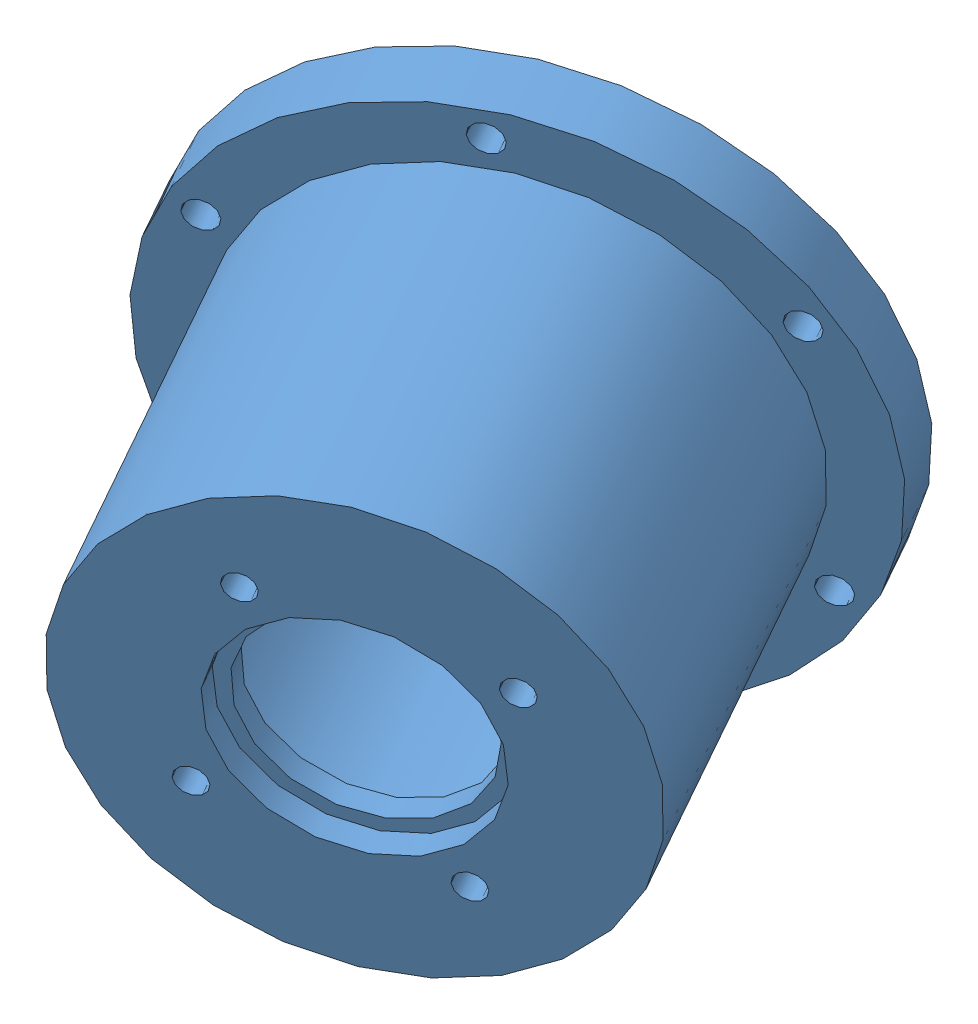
SolidWorks assembly BEARING AND GEARBOX MNT ASSEMBLY.sldasm, configuration Default (file format 7000). Lengths in mm.
Overall size (192.29 187.53 160.54).
16 component instances, 4 part files, 2 mates.
Components (placement in the parent):
- GEARBOX  ENDPLATE MNT RING-1: GEARBOX  ENDPLATE MNT RING.sldprt [Default] at (14.3504 0.3648 -14.5141) x (-0.410165 0.838546 0.358617) z (-0.808399 -0.516314 0.282685) size (127 88.9 127)
- 1 INCH BORE BALLBEARING-1: 1 INCH BORE BALLBEARING.sldasm [Default] at (-17.9662 13.6801 -82.6108) x (0.850635 0.415233 -0.322493) z (0.422203 -0.173959 0.889653) size (88.9 88.9 14.27)
  - 1 INCH BORE BALLBEARING-1: 1 INCH BORE BALLBEARING.sldprt [Default] at origin size (55.52 55.52 12.67)
  - 1 INCH BORE BALLBEARING--BALL-1: 1 INCH BORE BALLBEARING--BALL.sldprt [Default] at (0 19 0) x (0 0 1) z (-1 0 0) size (7.92 7.92 7.92)
  - 1 INCH BORE BALLBEARING--BALL-2: 1 INCH BORE BALLBEARING--BALL.sldprt [Default] at (9.5 16.4545 0) x (0 0 1) z (-0.866025 0.5 0) size (7.92 7.92 7.92)
  - 1 INCH BORE BALLBEARING--BALL-3: 1 INCH BORE BALLBEARING--BALL.sldprt [Default] at (16.4545 9.5 0) x (0 0 1) z (-0.5 0.866025 0) size (7.92 7.92 7.92)
  - 1 INCH BORE BALLBEARING--BALL-4: 1 INCH BORE BALLBEARING--BALL.sldprt [Default] at (19 0 0) x (0 0 1) z (0 1 0) size (7.92 7.92 7.92)
  - 1 INCH BORE BALLBEARING--BALL-5: 1 INCH BORE BALLBEARING--BALL.sldprt [Default] at (16.4545 -9.5 0) x (0 0 1) z (0.5 0.866025 0) size (7.92 7.92 7.92)
  - 1 INCH BORE BALLBEARING--BALL-6: 1 INCH BORE BALLBEARING--BALL.sldprt [Default] at (9.5 -16.4545 0) x (0 0 1) z (0.866025 0.5 0) size (7.92 7.92 7.92)
  - 1 INCH BORE BALLBEARING--BALL-7: 1 INCH BORE BALLBEARING--BALL.sldprt [Default] at (0 -19 0) x (0 0 1) z (1 0 0) size (7.92 7.92 7.92)
  - 1 INCH BORE BALLBEARING--BALL-8: 1 INCH BORE BALLBEARING--BALL.sldprt [Default] at (-9.5 -16.4545 0) x (0 0 1) z (0.866025 -0.5 0) size (7.92 7.92 7.92)
  - 1 INCH BORE BALLBEARING--BALL-9: 1 INCH BORE BALLBEARING--BALL.sldprt [Default] at (-16.4545 -9.5 0) x (0 0 1) z (0.5 -0.866025 0) size (7.92 7.92 7.92)
  - 1 INCH BORE BALLBEARING--BALL-10: 1 INCH BORE BALLBEARING--BALL.sldprt [Default] at (-19 0 0) x (0 0 1) z (0 -1 0) size (7.92 7.92 7.92)
  - 1 INCH BORE BALLBEARING--BALL-11: 1 INCH BORE BALLBEARING--BALL.sldprt [Default] at (-16.4545 9.5 0) x (0 0 1) z (-0.5 -0.866025 0) size (7.92 7.92 7.92)
  - 1 INCH BORE BALLBEARING--BALL-12: 1 INCH BORE BALLBEARING--BALL.sldprt [Default] at (-9.5 16.4545 0) x (0 0 1) z (-0.866025 -0.5 0) size (7.92 7.92 7.92)
  - 1 INCH BORE BALLBEARING MNT RING-1: 1 INCH BORE BALLBEARING MNT RING.sldprt [Default] at (0 0 -0.8001) size (88.9 88.9 12.7)
Mates (geometry in assembly coordinates):
- Coincident7: coincident anti-aligned: axis of GEARBOX  ENDPLATE MNT RING-1 through (-18.3136 13.8232 -83.3429) axis (0.422203 -0.173959 0.889653); axis of 1 INCH BORE BALLBEARING-1/1 INCH BORE BALLBEARING-1 through (-15.623 12.7146 -77.6733) axis (-0.422203 0.173959 -0.889653)
- Coincident8: coincident anti-aligned: plane of GEARBOX  ENDPLATE MNT RING-1 through (-33.8548 49.9879 -61.7328) normal (-0.422203 0.173959 -0.889653); plane of 1 INCH BORE BALLBEARING-1/1 INCH BORE BALLBEARING MNT RING-1 through (-15.623 12.7146 -77.6733) normal (0.422203 -0.173959 0.889653)
